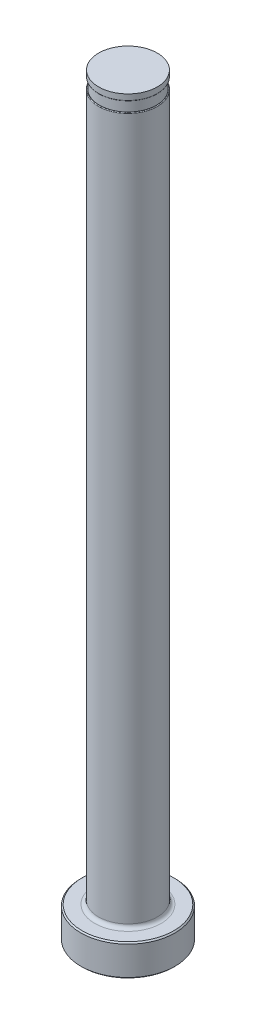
from build123d import *

# Parameters (mm, degrees)
CHAMFER1_SIZE     = 0.254
FILLET1_R         = 0.762
SKETCH2_W         = 0.2032
SKETCH2_H         = 2.032
D_SLOT_DEPTH      = 153.9941543
D_SLOT_DEPTH_BACK = 153.9941543
SKETCH5_W         = 0.01905
SKETCH5_H         = 1.27
FILLET2_R         = 0.127


with BuildPart() as part:
    # Sketch1 → Revolve1 (revolve)
    with BuildSketch(Plane.XY, mode=Mode.PRIVATE) as revolve1_sk:
        Polygon((0, 0), (-9.525, 0), (-9.525, 6.35), (-5.95249, 6.35), (-5.95249, 152.4), (0, 152.4), align=None)
    revolve(revolve1_sk.sketch.rotate(Axis((0, 259.958771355, 0), (0, -1, 0)), 270), axis=Axis((0, 259.958771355, 0), (0, -1, 0)))

    # Chamfer1
    chamfer1_edges = [part.edges().sort_by_distance(p)[0] for p in [
        (0, 6.35, -9.525),
        (0, 0, -9.525),
    ]]
    chamfer(chamfer1_edges, length=CHAMFER1_SIZE)

    # Fillet1
    fillet1_edges = [part.edges().sort_by_distance(p)[0] for p in [
        (0, 6.35, -5.95249),
    ]]
    fillet(fillet1_edges, radius=FILLET1_R)

    # Sketch2 → Vent Relief (revolve, cut)
    with BuildSketch(Plane.XY, mode=Mode.PRIVATE) as vent_relief_sk:
        with Locations((-5.85089, 150.114)):
            Rectangle(SKETCH2_W, SKETCH2_H)
    revolve(vent_relief_sk.sketch.rotate(Axis((0, 153.448281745, 0), (0, -1, 0)), 270), axis=Axis((0, 153.448281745, 0), (0, -1, 0)), mode=Mode.SUBTRACT)

    # Sketch3 → D-Slot (cut, two sides: drawn at the far end of the back side and taken through both)
    with BuildSketch(Plane.XY.offset(-D_SLOT_DEPTH_BACK)):
        with BuildLine():
            Line((-5.74929, 150.114), (-5.74929, 86.614))
            ThreePointArc((-5.74929, 86.614), (-5.800503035, 86.046038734), (-5.95249, 85.4964))
            Line((-5.95249, 85.4964), (-5.95249, 150.114))
            Line((-5.95249, 150.114), (-5.74929, 150.114))
        make_face()
    extrude(amount=D_SLOT_DEPTH + D_SLOT_DEPTH_BACK, mode=Mode.SUBTRACT)

    # Sketch5 → Vent Diameter (revolve, cut)
    with BuildSketch(Plane.XY, mode=Mode.PRIVATE) as vent_diameter_sk:
        with Locations((-5.942965, 151.765)):
            Rectangle(SKETCH5_W, SKETCH5_H)
    revolve(vent_diameter_sk.sketch.rotate(Axis((0, 152.687735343, 0), (0, -1, 0)), 90), axis=Axis((0, 152.687735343, 0), (0, -1, 0)), mode=Mode.SUBTRACT)

    # Fillet2
    fillet2_edges = [part.edges().sort_by_distance(p)[0] for p in [
        (4.722867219, 149.098, -3.623073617),
        (0, 151.13, 5.93344),
    ]]
    fillet(fillet2_edges, radius=FILLET2_R)


solid = part.part
